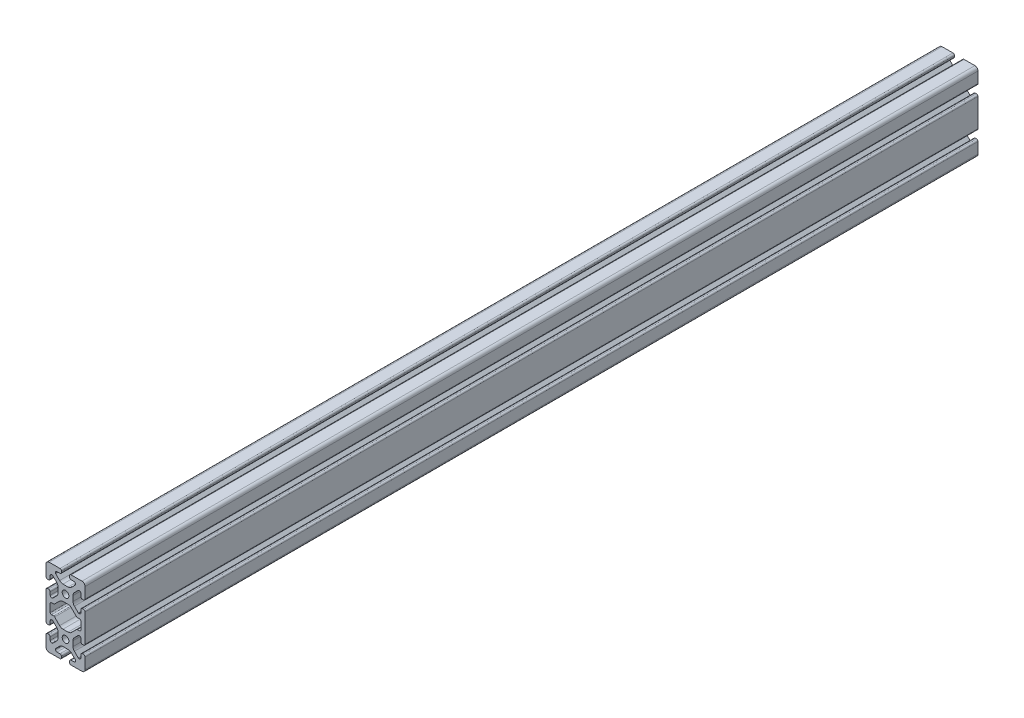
from build123d import *

# Parameters (mm, degrees)
SKETCH1_R           = 3.405
BOSS_EXTRUDE1_DEPTH = 3048
SKETCH26_W          = 40
SKETCH26_H          = 80.80011746
CUT_1_3FT_DEPTH     = 2135.537177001
SKETCH33_W          = 40
SKETCH33_H          = 80.80011746
CUT_2_3FT_DEPTH     = 1221.839317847


with BuildPart() as part:
    # Sketch1 → Boss-Extrude1 (new body)
    with BuildSketch(Plane(origin=(0, 0, -3048), x_dir=(-1, 0, 0), z_dir=(0, 0, -1))):
        with BuildLine():
            Line((16.83, 60), (5.69044933, 60))
            ThreePointArc((5.69044933, 60), (4.580291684, 59.540157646), (4.12044933, 58.43))
            Line((4.12044933, 58.43), (4.12044933, 57.25))
            ThreePointArc((4.12044933, 57.25), (4.580291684, 56.139842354), (5.69044933, 55.68))
            Line((5.69044933, 55.68), (8.7153995, 55.68))
            ThreePointArc((8.7153995, 55.68), (9.825557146, 55.220157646), (10.2853995, 54.11))
            Line((10.2853995, 54.11), (10.2853995, 53.654903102))
            ThreePointArc((10.2853995, 53.654903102), (10.227547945, 53.364063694), (10.062800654, 53.117501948))
            Line((10.062800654, 53.117501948), (6.055092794, 49.109794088))
            ThreePointArc((6.055092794, 49.109794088), (4.47691877, 48.055291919), (2.615335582, 47.685))
            Line((2.615335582, 47.685), (-2.615335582, 47.685))
            ThreePointArc((-2.615335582, 47.685), (-4.47691877, 48.055291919), (-6.055092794, 49.109794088))
            Line((-6.055092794, 49.109794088), (-10.062800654, 53.117501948))
            ThreePointArc((-10.062800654, 53.117501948), (-10.227547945, 53.364063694), (-10.2853995, 53.654903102))
            Line((-10.2853995, 53.654903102), (-10.2853995, 54.11))
            ThreePointArc((-10.2853995, 54.11), (-9.825557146, 55.220157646), (-8.7153995, 55.68))
            Line((-8.7153995, 55.68), (-5.69044933, 55.68))
            ThreePointArc((-5.69044933, 55.68), (-4.580291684, 56.139842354), (-4.12044933, 57.25))
            Line((-4.12044933, 57.25), (-4.12044933, 58.43))
            ThreePointArc((-4.12044933, 58.43), (-4.580291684, 59.540157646), (-5.69044933, 60))
            Line((-5.69044933, 60), (-16.83, 60))
            ThreePointArc((-16.83, 60), (-19.071528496, 59.071528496), (-20, 56.83))
            Line((-20, 56.83), (-20, 45.69044933))
            ThreePointArc((-20, 45.69044933), (-19.540157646, 44.580291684), (-18.43, 44.12044933))
            Line((-18.43, 44.12044933), (-17.25, 44.12044933))
            ThreePointArc((-17.25, 44.12044933), (-16.139842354, 44.580291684), (-15.68, 45.69044933))
            Line((-15.68, 45.69044933), (-15.68, 48.7153995))
            ThreePointArc((-15.68, 48.7153995), (-15.220157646, 49.825557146), (-14.11, 50.2853995))
            Line((-14.11, 50.2853995), (-13.652670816, 50.2853995))
            ThreePointArc((-13.652670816, 50.2853995), (-13.361831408, 50.227547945), (-13.115269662, 50.062800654))
            Line((-13.115269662, 50.062800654), (-9.109794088, 46.05732508))
            ThreePointArc((-9.109794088, 46.05732508), (-8.055291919, 44.479151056), (-7.685, 42.617567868))
            Line((-7.685, 42.617567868), (-7.685, 37.384664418))
            ThreePointArc((-7.685, 37.384664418), (-8.055291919, 35.52308123), (-9.109794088, 33.944907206))
            Line((-9.109794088, 33.944907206), (-13.117501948, 29.937199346))
            ThreePointArc((-13.117501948, 29.937199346), (-13.364063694, 29.772452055), (-13.654903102, 29.7146005))
            Line((-13.654903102, 29.7146005), (-14.11, 29.7146005))
            ThreePointArc((-14.11, 29.7146005), (-15.220157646, 30.174442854), (-15.68, 31.2846005))
            Line((-15.68, 31.2846005), (-15.68, 34.30955067))
            ThreePointArc((-15.68, 34.30955067), (-16.139842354, 35.419708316), (-17.25, 35.87955067))
            Line((-17.25, 35.87955067), (-18.43, 35.87955067))
            ThreePointArc((-18.43, 35.87955067), (-19.540157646, 35.419708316), (-20, 34.30955067))
            Line((-20, 34.30955067), (-20, 5.69044933))
            ThreePointArc((-20, 5.69044933), (-19.540157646, 4.580291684), (-18.43, 4.12044933))
            Line((-18.43, 4.12044933), (-17.25, 4.12044933))
            ThreePointArc((-17.25, 4.12044933), (-16.139842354, 4.580291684), (-15.68, 5.69044933))
            Line((-15.68, 5.69044933), (-15.68, 8.7153995))
            ThreePointArc((-15.68, 8.7153995), (-15.220157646, 9.825557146), (-14.11, 10.2853995))
            Line((-14.11, 10.2853995), (-13.654903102, 10.2853995))
            ThreePointArc((-13.654903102, 10.2853995), (-13.364063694, 10.227547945), (-13.117501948, 10.062800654))
            Line((-13.117501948, 10.062800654), (-9.109794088, 6.055092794))
            ThreePointArc((-9.109794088, 6.055092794), (-8.055291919, 4.47691877), (-7.685, 2.615335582))
            Line((-7.685, 2.615335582), (-7.685, -2.615335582))
            ThreePointArc((-7.685, -2.615335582), (-8.055291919, -4.47691877), (-9.109794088, -6.055092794))
            Line((-9.109794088, -6.055092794), (-13.117501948, -10.062800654))
            ThreePointArc((-13.117501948, -10.062800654), (-13.364063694, -10.227547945), (-13.654903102, -10.2853995))
            Line((-13.654903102, -10.2853995), (-14.11, -10.2853995))
            ThreePointArc((-14.11, -10.2853995), (-15.220157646, -9.825557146), (-15.68, -8.7153995))
            Line((-15.68, -8.7153995), (-15.68, -5.69044933))
            ThreePointArc((-15.68, -5.69044933), (-16.139842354, -4.580291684), (-17.25, -4.12044933))
            Line((-17.25, -4.12044933), (-18.43, -4.12044933))
            ThreePointArc((-18.43, -4.12044933), (-19.540157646, -4.580291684), (-20, -5.69044933))
            Line((-20, -5.69044933), (-20, -16.83))
            ThreePointArc((-20, -16.83), (-19.071528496, -19.071528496), (-16.83, -20))
            Line((-16.83, -20), (-5.69044933, -20))
            ThreePointArc((-5.69044933, -20), (-4.580291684, -19.540157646), (-4.12044933, -18.43))
            Line((-4.12044933, -18.43), (-4.12044933, -17.25))
            ThreePointArc((-4.12044933, -17.25), (-4.580291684, -16.139842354), (-5.69044933, -15.68))
            Line((-5.69044933, -15.68), (-8.7153995, -15.68))
            ThreePointArc((-8.7153995, -15.68), (-9.825557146, -15.220157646), (-10.2853995, -14.11))
            Line((-10.2853995, -14.11), (-10.2853995, -13.654903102))
            ThreePointArc((-10.2853995, -13.654903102), (-10.227547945, -13.364063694), (-10.062800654, -13.117501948))
            Line((-10.062800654, -13.117501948), (-6.055092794, -9.109794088))
            ThreePointArc((-6.055092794, -9.109794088), (-4.47691877, -8.055291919), (-2.615335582, -7.685))
            Line((-2.615335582, -7.685), (2.615335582, -7.685))
            ThreePointArc((2.615335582, -7.685), (4.47691877, -8.055291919), (6.055092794, -9.109794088))
            Line((6.055092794, -9.109794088), (10.062800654, -13.117501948))
            ThreePointArc((10.062800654, -13.117501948), (10.227547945, -13.364063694), (10.2853995, -13.654903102))
            Line((10.2853995, -13.654903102), (10.2853995, -14.11))
            ThreePointArc((10.2853995, -14.11), (9.825557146, -15.220157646), (8.7153995, -15.68))
            Line((8.7153995, -15.68), (5.69044933, -15.68))
            ThreePointArc((5.69044933, -15.68), (4.580291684, -16.139842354), (4.12044933, -17.25))
            Line((4.12044933, -17.25), (4.12044933, -18.43))
            ThreePointArc((4.12044933, -18.43), (4.580291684, -19.540157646), (5.69044933, -20))
            Line((5.69044933, -20), (16.83, -20))
            ThreePointArc((16.83, -20), (19.071528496, -19.071528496), (20, -16.83))
            Line((20, -16.83), (20, -5.69044933))
            ThreePointArc((20, -5.69044933), (19.540157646, -4.580291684), (18.43, -4.12044933))
            Line((18.43, -4.12044933), (17.25, -4.12044933))
            ThreePointArc((17.25, -4.12044933), (16.139842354, -4.580291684), (15.68, -5.69044933))
            Line((15.68, -5.69044933), (15.68, -8.7153995))
            ThreePointArc((15.68, -8.7153995), (15.220157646, -9.825557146), (14.11, -10.2853995))
            Line((14.11, -10.2853995), (13.654903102, -10.2853995))
            ThreePointArc((13.654903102, -10.2853995), (13.364063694, -10.227547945), (13.117501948, -10.062800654))
            Line((13.117501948, -10.062800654), (9.109794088, -6.055092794))
            ThreePointArc((9.109794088, -6.055092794), (8.055291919, -4.47691877), (7.685, -2.615335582))
            Line((7.685, -2.615335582), (7.685, 2.615335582))
            ThreePointArc((7.685, 2.615335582), (8.055291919, 4.47691877), (9.109794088, 6.055092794))
            Line((9.109794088, 6.055092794), (13.117501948, 10.062800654))
            ThreePointArc((13.117501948, 10.062800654), (13.364063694, 10.227547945), (13.654903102, 10.2853995))
            Line((13.654903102, 10.2853995), (14.11, 10.2853995))
            ThreePointArc((14.11, 10.2853995), (15.220157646, 9.825557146), (15.68, 8.7153995))
            Line((15.68, 8.7153995), (15.68, 5.69044933))
            ThreePointArc((15.68, 5.69044933), (16.139842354, 4.580291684), (17.25, 4.12044933))
            Line((17.25, 4.12044933), (18.43, 4.12044933))
            ThreePointArc((18.43, 4.12044933), (19.540157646, 4.580291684), (20, 5.69044933))
            Line((20, 5.69044933), (20, 34.30955067))
            ThreePointArc((20, 34.30955067), (19.540157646, 35.419708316), (18.43, 35.87955067))
            Line((18.43, 35.87955067), (17.25, 35.87955067))
            ThreePointArc((17.25, 35.87955067), (16.139842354, 35.419708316), (15.68, 34.30955067))
            Line((15.68, 34.30955067), (15.68, 31.2846005))
            ThreePointArc((15.68, 31.2846005), (15.220157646, 30.174442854), (14.11, 29.7146005))
            Line((14.11, 29.7146005), (13.654903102, 29.7146005))
            ThreePointArc((13.654903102, 29.7146005), (13.364063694, 29.772452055), (13.117501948, 29.937199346))
            Line((13.117501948, 29.937199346), (9.109794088, 33.944907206))
            ThreePointArc((9.109794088, 33.944907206), (8.055291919, 35.52308123), (7.685, 37.384664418))
            Line((7.685, 37.384664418), (7.685, 42.615335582))
            ThreePointArc((7.685, 42.615335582), (8.055291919, 44.47691877), (9.109794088, 46.055092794))
            Line((9.109794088, 46.055092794), (13.117501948, 50.062800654))
            ThreePointArc((13.117501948, 50.062800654), (13.364063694, 50.227547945), (13.654903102, 50.2853995))
            Line((13.654903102, 50.2853995), (14.11, 50.2853995))
            ThreePointArc((14.11, 50.2853995), (15.220157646, 49.825557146), (15.68, 48.7153995))
            Line((15.68, 48.7153995), (15.68, 45.69044933))
            ThreePointArc((15.68, 45.69044933), (16.139842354, 44.580291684), (17.25, 44.12044933))
            Line((17.25, 44.12044933), (18.43, 44.12044933))
            ThreePointArc((18.43, 44.12044933), (19.540157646, 44.580291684), (20, 45.69044933))
            Line((20, 45.69044933), (20, 56.83))
            ThreePointArc((20, 56.83), (19.071528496, 59.071528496), (16.83, 60))
        make_face()
        with Locations(Location((0, 0, 0), (0, 0, 180))):
            Circle(SKETCH1_R, mode=Mode.SUBTRACT)
        with Locations(Location((0, 40, 0), (0, 0, 180))):
            Circle(SKETCH1_R, mode=Mode.SUBTRACT)
        with BuildLine():
            Line((14.41, 14.65864833), (12.129998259, 14.65864833))
            ThreePointArc((12.129998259, 14.65864833), (11.608780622, 14.546764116), (11.179399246, 14.230824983))
            Line((11.179399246, 14.230824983), (6.055092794, 9.109794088))
            ThreePointArc((6.055092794, 9.109794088), (4.47691877, 8.055291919), (2.615335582, 7.685))
            Line((2.615335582, 7.685), (-2.615335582, 7.685))
            ThreePointArc((-2.615335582, 7.685), (-4.47691877, 8.055291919), (-6.055092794, 9.109794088))
            Line((-6.055092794, 9.109794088), (-11.231972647, 14.286673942))
            ThreePointArc((-11.231972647, 14.286673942), (-11.6439903, 14.561975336), (-12.129998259, 14.65864833))
            Line((-12.129998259, 14.65864833), (-14.41, 14.65864833))
            ThreePointArc((-14.41, 14.65864833), (-15.308025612, 15.030622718), (-15.68, 15.92864833))
            Line((-15.68, 15.92864833), (-15.68, 24.07135167))
            ThreePointArc((-15.68, 24.07135167), (-15.308025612, 24.969377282), (-14.41, 25.34135167))
            Line((-14.41, 25.34135167), (-12.129998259, 25.34135167))
            ThreePointArc((-12.129998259, 25.34135167), (-11.6439903, 25.438024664), (-11.231972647, 25.713326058))
            Line((-11.231972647, 25.713326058), (-6.055092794, 30.890205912))
            ThreePointArc((-6.055092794, 30.890205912), (-4.47691877, 31.944708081), (-2.615335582, 32.315))
            Line((-2.615335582, 32.315), (2.617567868, 32.315))
            ThreePointArc((2.617567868, 32.315), (4.479151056, 31.944708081), (6.05732508, 30.890205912))
            Line((6.05732508, 30.890205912), (11.184160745, 25.763370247))
            ThreePointArc((11.184160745, 25.763370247), (11.612140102, 25.451641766), (12.129998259, 25.34135167))
            Line((12.129998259, 25.34135167), (14.41, 25.34135167))
            ThreePointArc((14.41, 25.34135167), (15.308025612, 24.969377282), (15.68, 24.07135167))
            Line((15.68, 24.07135167), (15.68, 15.92864833))
            ThreePointArc((15.68, 15.92864833), (15.308025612, 15.030622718), (14.41, 14.65864833))
        make_face(mode=Mode.SUBTRACT)
    extrude(amount=-BOSS_EXTRUDE1_DEPTH)

    # Sketch26 → Cut 1 - 3ft (cut, through all)
    with BuildSketch(Plane.XY.offset(-914.4)):
        with Locations((0, 19.59994127)):
            Rectangle(SKETCH26_W, SKETCH26_H)
    extrude(amount=CUT_1_3FT_DEPTH, mode=Mode.SUBTRACT)

    # Sketch33 → Cut 2 - 3ft (cut, through all)
    with BuildSketch(Plane.XY.offset(-1828.8)):
        with Locations((0, 19.59994127)):
            Rectangle(SKETCH33_W, SKETCH33_H)
    extrude(amount=-CUT_2_3FT_DEPTH, mode=Mode.SUBTRACT)


solid = part.part
